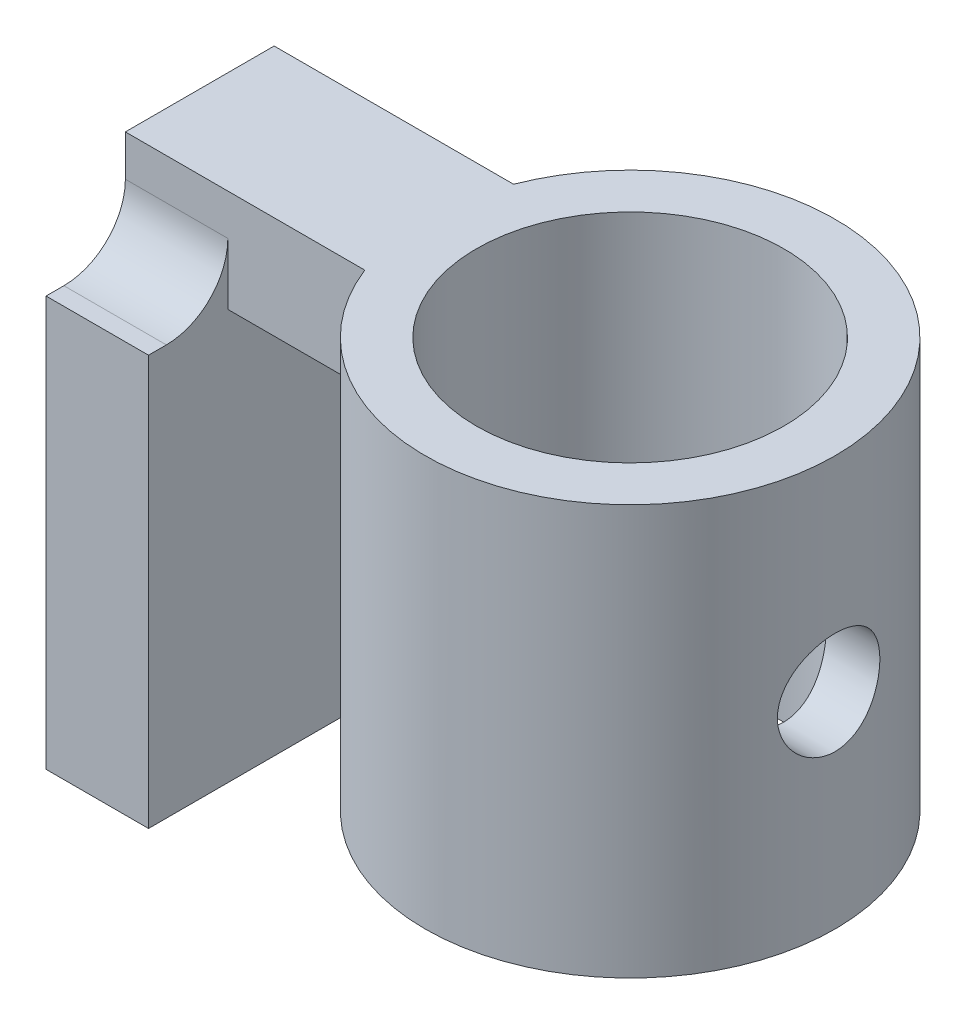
ISO-10303-21;
HEADER;
FILE_DESCRIPTION(('STEP AP214'),'2;1');
FILE_NAME('part.step','',(''),(''),'','','');
FILE_SCHEMA(('AUTOMOTIVE_DESIGN { 1 0 10303 214 1 1 1 1 }'));
ENDSEC;
DATA;
#1=APPLICATION_CONTEXT('core data for automotive mechanical design processes');
#2=APPLICATION_PROTOCOL_DEFINITION('international standard','automotive_design',2000,#1);
#3=PRODUCT_CONTEXT('',#1,'mechanical');
#4=PRODUCT('Part','Part','',(#3));
#5=PRODUCT_RELATED_PRODUCT_CATEGORY('part','',(#4));
#6=PRODUCT_DEFINITION_FORMATION('','',#4);
#7=PRODUCT_DEFINITION_CONTEXT('part definition',#1,'design');
#8=PRODUCT_DEFINITION('design','',#6,#7);
#9=PRODUCT_DEFINITION_SHAPE('','',#8);
#10=(LENGTH_UNIT() NAMED_UNIT(*) SI_UNIT(.MILLI.,.METRE.));
#11=(NAMED_UNIT(*) PLANE_ANGLE_UNIT() SI_UNIT($,.RADIAN.));
#12=(NAMED_UNIT(*) SI_UNIT($,.STERADIAN.) SOLID_ANGLE_UNIT());
#13=UNCERTAINTY_MEASURE_WITH_UNIT(LENGTH_MEASURE(1.E-05),#10,'distance_accuracy_value','');
#14=(GEOMETRIC_REPRESENTATION_CONTEXT(3) GLOBAL_UNCERTAINTY_ASSIGNED_CONTEXT((#13)) GLOBAL_UNIT_ASSIGNED_CONTEXT((#10,
#11,#12)) REPRESENTATION_CONTEXT('',''));
#15=CARTESIAN_POINT('',(0.,0.,0.));
#16=DIRECTION('',(0.,0.,1.));
#17=DIRECTION('',(1.,0.,0.));
#18=AXIS2_PLACEMENT_3D('',#15,#16,#17);
#19=CARTESIAN_POINT('',(21.,25.,7.5));
#20=DIRECTION('',(0.,-1.,0.));
#21=DIRECTION('',(0.,0.,-1.));
#22=AXIS2_PLACEMENT_3D('',#19,#20,#21);
#23=CYLINDRICAL_SURFACE('',#22,10.);
#24=CARTESIAN_POINT('',(30.6824583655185,15.,10.));
#25=CARTESIAN_POINT('',(30.6824590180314,15.1381886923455,10.0000042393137));
#26=CARTESIAN_POINT('',(30.685538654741,15.276421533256,9.9881596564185));
#27=CARTESIAN_POINT('',(30.6973219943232,15.548921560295,9.94182137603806));
#28=CARTESIAN_POINT('',(30.7060340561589,15.6831825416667,9.90729401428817));
#29=CARTESIAN_POINT('',(30.727930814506,15.943673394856,9.81721754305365));
#30=CARTESIAN_POINT('',(30.7411051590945,16.0699210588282,9.76171705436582));
#31=CARTESIAN_POINT('',(30.7704754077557,16.3115091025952,9.63125731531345));
#32=CARTESIAN_POINT('',(30.7866692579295,16.4268568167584,9.55631127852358));
#33=CARTESIAN_POINT('',(30.8122390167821,16.5910723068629,9.42922591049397));
#34=CARTESIAN_POINT('',(30.8211293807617,16.6451366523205,9.383559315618));
#35=CARTESIAN_POINT('',(30.8390327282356,16.7490765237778,9.28768377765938));
#36=CARTESIAN_POINT('',(30.8480457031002,16.7989523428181,9.2374751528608));
#37=CARTESIAN_POINT('',(30.8659389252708,16.8940893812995,9.13280822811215));
#38=CARTESIAN_POINT('',(30.8748191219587,16.9393488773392,9.07834835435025));
#39=CARTESIAN_POINT('',(30.8921631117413,17.0250713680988,8.96573005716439));
#40=CARTESIAN_POINT('',(30.9006268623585,17.0655338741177,8.90757125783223));
#41=CARTESIAN_POINT('',(30.9246779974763,17.1778450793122,8.7307187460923));
#42=CARTESIAN_POINT('',(30.9393333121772,17.2426836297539,8.60734588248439));
#43=CARTESIAN_POINT('',(30.9645202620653,17.3517500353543,8.35138148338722));
#44=CARTESIAN_POINT('',(30.9750517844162,17.3959773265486,8.21878969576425));
#45=CARTESIAN_POINT('',(30.987025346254,17.4459905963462,8.01400059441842));
#46=CARTESIAN_POINT('',(30.9903961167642,17.4600077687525,7.9438435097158));
#47=CARTESIAN_POINT('',(30.995672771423,17.4819577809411,7.8025145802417));
#48=CARTESIAN_POINT('',(30.9975787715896,17.4898911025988,7.73134281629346));
#49=CARTESIAN_POINT('',(30.9998620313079,17.4994039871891,7.58859677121));
#50=CARTESIAN_POINT('',(31.000240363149,17.5009880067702,7.51702280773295));
#51=CARTESIAN_POINT('',(30.9994629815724,17.4977809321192,7.37404545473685));
#52=CARTESIAN_POINT('',(30.9983072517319,17.4929897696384,7.30264206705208));
#53=CARTESIAN_POINT('',(30.9928183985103,17.4703358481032,7.0984668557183));
#54=CARTESIAN_POINT('',(30.986592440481,17.4447139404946,6.96652726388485));
#55=CARTESIAN_POINT('',(30.9694772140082,17.3731224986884,6.70860138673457));
#56=CARTESIAN_POINT('',(30.9585833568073,17.3271329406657,6.58262109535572));
#57=CARTESIAN_POINT('',(30.9326997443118,17.2140307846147,6.33486212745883));
#58=CARTESIAN_POINT('',(30.9175671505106,17.1461661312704,6.21343749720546));
#59=CARTESIAN_POINT('',(30.8931982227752,17.0303393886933,6.04122590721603));
#60=CARTESIAN_POINT('',(30.8847970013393,16.9893926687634,5.9854767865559));
#61=CARTESIAN_POINT('',(30.8676675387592,16.9029919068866,5.87762273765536));
#62=CARTESIAN_POINT('',(30.8589393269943,16.8575382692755,5.82551748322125));
#63=CARTESIAN_POINT('',(30.8412570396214,16.7614605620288,5.72451669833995));
#64=CARTESIAN_POINT('',(30.8323017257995,16.7107581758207,5.67569579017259));
#65=CARTESIAN_POINT('',(30.8145808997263,16.6052904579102,5.58264640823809));
#66=CARTESIAN_POINT('',(30.8058154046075,16.5505247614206,5.53841834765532));
#67=CARTESIAN_POINT('',(30.7801348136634,16.3807312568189,5.41282940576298));
#68=CARTESIAN_POINT('',(30.7638385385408,16.2602224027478,5.33857977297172));
#69=CARTESIAN_POINT('',(30.7347855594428,16.0093278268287,5.21129007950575));
#70=CARTESIAN_POINT('',(30.7220037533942,15.8790210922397,5.15809834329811));
#71=CARTESIAN_POINT('',(30.7012974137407,15.6110901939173,5.07373935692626));
#72=CARTESIAN_POINT('',(30.6933680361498,15.4734734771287,5.0425501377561));
#73=CARTESIAN_POINT('',(30.6859451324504,15.2643724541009,5.01352778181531));
#74=CARTESIAN_POINT('',(30.6842169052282,15.1941054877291,5.00681766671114));
#75=CARTESIAN_POINT('',(30.6823481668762,15.0532351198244,4.99957068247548));
#76=CARTESIAN_POINT('',(30.6822075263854,14.982631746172,4.9990333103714));
#77=CARTESIAN_POINT('',(30.6842097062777,14.7711943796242,5.00677497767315));
#78=CARTESIAN_POINT('',(30.6887725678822,14.6306209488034,5.02439214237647));
#79=CARTESIAN_POINT('',(30.7030557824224,14.3627471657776,5.08101887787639));
#80=CARTESIAN_POINT('',(30.7124664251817,14.2351474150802,5.11874809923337));
#81=CARTESIAN_POINT('',(30.7351629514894,13.9874568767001,5.21330678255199));
#82=CARTESIAN_POINT('',(30.7484505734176,13.8673694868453,5.27014481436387));
#83=CARTESIAN_POINT('',(30.7707911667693,13.6912132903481,5.37093351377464));
#84=CARTESIAN_POINT('',(30.7789409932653,13.631336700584,5.40859122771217));
#85=CARTESIAN_POINT('',(30.7957526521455,13.5150117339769,5.48880366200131));
#86=CARTESIAN_POINT('',(30.8044144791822,13.458563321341,5.5313583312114));
#87=CARTESIAN_POINT('',(30.8220123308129,13.3496099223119,5.6211267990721));
#88=CARTESIAN_POINT('',(30.8309481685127,13.2971023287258,5.66833746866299));
#89=CARTESIAN_POINT('',(30.8488610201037,13.1965020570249,5.76723967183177));
#90=CARTESIAN_POINT('',(30.8578380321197,13.1484091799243,5.81893100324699));
#91=CARTESIAN_POINT('',(30.8753912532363,13.0577077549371,5.92535663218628));
#92=CARTESIAN_POINT('',(30.8839717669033,13.015016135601,5.98001949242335));
#93=CARTESIAN_POINT('',(30.9006507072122,12.9343024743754,6.09274400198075));
#94=CARTESIAN_POINT('',(30.9087491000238,12.8962807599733,6.15080588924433));
#95=CARTESIAN_POINT('',(30.9319955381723,12.7894084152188,6.32958708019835));
#96=CARTESIAN_POINT('',(30.946088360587,12.7277826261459,6.45486401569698));
#97=CARTESIAN_POINT('',(30.9701823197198,12.6243312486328,6.71697604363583));
#98=CARTESIAN_POINT('',(30.9800868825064,12.5829698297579,6.85400444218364));
#99=CARTESIAN_POINT('',(30.9907060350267,12.5387311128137,7.06329711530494));
#100=CARTESIAN_POINT('',(30.9935392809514,12.5269528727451,7.13366723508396));
#101=CARTESIAN_POINT('',(30.9977233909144,12.5095266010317,7.27521789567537));
#102=CARTESIAN_POINT('',(30.9990744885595,12.5038776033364,7.34639830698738));
#103=CARTESIAN_POINT('',(31.0002287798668,12.4990523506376,7.48664565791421));
#104=CARTESIAN_POINT('',(31.000081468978,12.4996691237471,7.55570502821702));
#105=CARTESIAN_POINT('',(30.9983661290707,12.5068387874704,7.69348098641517));
#106=CARTESIAN_POINT('',(30.9967980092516,12.5133920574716,7.76219755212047));
#107=CARTESIAN_POINT('',(30.9900116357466,12.5416427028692,7.96720562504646));
#108=CARTESIAN_POINT('',(30.982711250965,12.5719313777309,8.10233958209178));
#109=CARTESIAN_POINT('',(30.9635719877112,12.6526885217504,8.36251218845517));
#110=CARTESIAN_POINT('',(30.9518413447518,12.7026768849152,8.48771153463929));
#111=CARTESIAN_POINT('',(30.9249872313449,12.8213740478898,8.72852080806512));
#112=CARTESIAN_POINT('',(30.9098655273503,12.8900731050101,8.84413568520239));
#113=CARTESIAN_POINT('',(30.885284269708,13.008586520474,9.01150117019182));
#114=CARTESIAN_POINT('',(30.8764843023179,13.0522057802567,9.06783110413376));
#115=CARTESIAN_POINT('',(30.8586309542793,13.1442165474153,9.17642933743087));
#116=CARTESIAN_POINT('',(30.8495775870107,13.1926078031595,9.22869785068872));
#117=CARTESIAN_POINT('',(30.8314992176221,13.2938833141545,9.32871916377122));
#118=CARTESIAN_POINT('',(30.8224742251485,13.3467689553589,9.37647056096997));
#119=CARTESIAN_POINT('',(30.8046982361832,13.456481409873,9.46723873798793));
#120=CARTESIAN_POINT('',(30.7959472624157,13.5133085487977,9.51025512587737));
#121=CARTESIAN_POINT('',(30.7709574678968,13.6856962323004,9.62952449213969));
#122=CARTESIAN_POINT('',(30.7554237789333,13.8061928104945,9.69895029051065));
#123=CARTESIAN_POINT('',(30.7279657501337,14.0571100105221,9.81741245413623));
#124=CARTESIAN_POINT('',(30.7160399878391,14.187526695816,9.86645685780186));
#125=CARTESIAN_POINT('',(30.6988430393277,14.4313379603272,9.93587273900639));
#126=CARTESIAN_POINT('',(30.6927690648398,14.5436768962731,9.95977607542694));
#127=CARTESIAN_POINT('',(30.6845778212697,14.7706681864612,9.99183251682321));
#128=CARTESIAN_POINT('',(30.6824578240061,14.8853188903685,9.99999648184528));
#129=CARTESIAN_POINT('',(30.6824583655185,15.,10.));
#130=B_SPLINE_CURVE_WITH_KNOTS('',3,(#24,#25,#26,#27,#28,#29,#30,#31,#32,#33,#34,#35,#36,#37,
#38,#39,#40,#41,#42,#43,#44,#45,#46,#47,#48,#49,#50,#51,#52,#53,#54,#55,#56,#57,#58,#59,#60,#61,
#62,#63,#64,#65,#66,#67,#68,#69,#70,#71,#72,#73,#74,#75,#76,#77,#78,#79,#80,#81,#82,#83,#84,#85,
#86,#87,#88,#89,#90,#91,#92,#93,#94,#95,#96,#97,#98,#99,#100,#101,#102,#103,#104,#105,#106,#107,
#108,#109,#110,#111,#112,#113,#114,#115,#116,#117,#118,#119,#120,#121,#122,#123,#124,#125,#126,
#127,#128,#129),.UNSPECIFIED.,.T.,.F.,(4,2,2,2,2,2,2,2,2,2,2,2,2,2,2,2,2,2,2,2,2,2,2,2,2,2,2,2,
2,2,2,2,2,2,2,2,2,2,2,2,2,2,2,2,2,2,2,2,2,2,2,2,4),(0.,0.41414866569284,0.828913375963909,
1.24272240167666,1.65625097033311,1.87000947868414,2.08375301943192,2.29757606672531,
2.51142087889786,2.92986497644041,3.34832052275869,3.5629536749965,3.77756982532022,
3.99203530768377,4.20650308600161,4.60816153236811,5.01021573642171,5.4279089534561,
5.63675131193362,5.84557495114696,6.05815598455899,6.27075612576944,6.6960227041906,
7.11816787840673,7.53989095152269,7.75146649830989,7.96302480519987,8.38580648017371,
8.78442196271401,9.18321645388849,9.39661366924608,9.6100086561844,9.8232611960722,
10.0365041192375,10.2459123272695,10.4553352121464,10.8743293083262,11.3025177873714,
11.5164988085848,11.7304460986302,11.9373498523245,12.1442668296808,12.5581479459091,
12.9625107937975,13.3666634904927,13.5817938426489,13.7969128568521,14.0120984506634,
14.2273018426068,14.6450685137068,15.0626702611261,15.4066045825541,15.7503015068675),.UNSPECIFIED.);
#131=CARTESIAN_POINT('',(30.6824583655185,15.,10.));
#132=VERTEX_POINT('',#131);
#133=EDGE_CURVE('E253',#132,#132,#130,.T.);
#134=ORIENTED_EDGE('',*,*,#133,.T.);
#135=EDGE_LOOP('',(#134));
#136=FACE_BOUND('',#135,.T.);
#137=DIRECTION('',(0.,-1.,0.));
#138=VECTOR('',#137,1.);
#139=CARTESIAN_POINT('',(11.6818162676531,25.,11.1292494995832));
#140=LINE('',#139,#138);
#141=CARTESIAN_POINT('',(11.6818162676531,25.,11.1292494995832));
#142=VERTEX_POINT('',#141);
#143=CARTESIAN_POINT('',(11.6818162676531,20.,11.1292494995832));
#144=VERTEX_POINT('',#143);
#145=EDGE_CURVE('E218',#142,#144,#140,.T.);
#146=ORIENTED_EDGE('',*,*,#145,.T.);
#147=CARTESIAN_POINT('',(21.,20.,7.5));
#148=DIRECTION('',(0.,1.,0.));
#149=DIRECTION('',(0.,0.,1.));
#150=AXIS2_PLACEMENT_3D('',#147,#148,#149);
#151=CIRCLE('',#150,10.);
#152=CARTESIAN_POINT('',(11.6818162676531,20.,3.87075050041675));
#153=VERTEX_POINT('',#152);
#154=EDGE_CURVE('E214',#153,#144,#151,.T.);
#155=ORIENTED_EDGE('',*,*,#154,.F.);
#156=DIRECTION('',(0.,-1.,0.));
#157=VECTOR('',#156,1.);
#158=CARTESIAN_POINT('',(11.6818162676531,25.,3.87075050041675));
#159=LINE('',#158,#157);
#160=CARTESIAN_POINT('',(11.6818162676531,25.,3.87075050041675));
#161=VERTEX_POINT('',#160);
#162=EDGE_CURVE('E234',#161,#153,#159,.T.);
#163=ORIENTED_EDGE('',*,*,#162,.F.);
#164=CARTESIAN_POINT('',(21.,25.,7.5));
#165=DIRECTION('',(0.,1.,0.));
#166=DIRECTION('',(0.,0.,1.));
#167=AXIS2_PLACEMENT_3D('',#164,#165,#166);
#168=CIRCLE('',#167,10.);
#169=EDGE_CURVE('E140',#142,#161,#168,.T.);
#170=ORIENTED_EDGE('',*,*,#169,.F.);
#171=EDGE_LOOP('',(#146,#155,#163,#170));
#172=FACE_BOUND('',#171,.T.);
#173=CARTESIAN_POINT('',(21.,5.,7.5));
#174=DIRECTION('',(0.,1.,0.));
#175=DIRECTION('',(0.,0.,1.));
#176=AXIS2_PLACEMENT_3D('',#173,#174,#175);
#177=CIRCLE('',#176,10.);
#178=CARTESIAN_POINT('',(21.,5.,17.5));
#179=VERTEX_POINT('',#178);
#180=EDGE_CURVE('E237',#179,#179,#177,.T.);
#181=ORIENTED_EDGE('',*,*,#180,.T.);
#182=EDGE_LOOP('',(#181));
#183=FACE_BOUND('',#182,.T.);
#184=ADVANCED_FACE('F44',(#136,#172,#183),#23,.T.);
#185=CARTESIAN_POINT('',(0.,25.,0.));
#186=DIRECTION('',(0.,1.,0.));
#187=DIRECTION('',(0.,0.,1.));
#188=AXIS2_PLACEMENT_3D('',#185,#186,#187);
#189=PLANE('',#188);
#190=CARTESIAN_POINT('',(21.,25.,7.5));
#191=DIRECTION('',(0.,1.,0.));
#192=DIRECTION('',(0.,0.,1.));
#193=AXIS2_PLACEMENT_3D('',#190,#191,#192);
#194=CIRCLE('',#193,7.5);
#195=CARTESIAN_POINT('',(21.,25.,15.));
#196=VERTEX_POINT('',#195);
#197=EDGE_CURVE('E166',#196,#196,#194,.T.);
#198=ORIENTED_EDGE('',*,*,#197,.F.);
#199=EDGE_LOOP('',(#198));
#200=FACE_BOUND('',#199,.T.);
#201=ORIENTED_EDGE('',*,*,#169,.T.);
#202=DIRECTION('',(-1.,0.,0.));
#203=VECTOR('',#202,1.);
#204=CARTESIAN_POINT('',(0.,25.,3.87075050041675));
#205=LINE('',#204,#203);
#206=CARTESIAN_POINT('',(0.,25.,3.87075050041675));
#207=VERTEX_POINT('',#206);
#208=EDGE_CURVE('E133',#161,#207,#205,.T.);
#209=ORIENTED_EDGE('',*,*,#208,.T.);
#210=DIRECTION('',(0.,0.,1.));
#211=VECTOR('',#210,1.);
#212=CARTESIAN_POINT('',(0.,25.,0.));
#213=LINE('',#212,#211);
#214=CARTESIAN_POINT('',(0.,25.,11.1292494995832));
#215=VERTEX_POINT('',#214);
#216=EDGE_CURVE('E137',#207,#215,#213,.T.);
#217=ORIENTED_EDGE('',*,*,#216,.T.);
#218=DIRECTION('',(-1.,0.,0.));
#219=VECTOR('',#218,1.);
#220=CARTESIAN_POINT('',(0.,25.,11.1292494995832));
#221=LINE('',#220,#219);
#222=EDGE_CURVE('E144',#142,#215,#221,.T.);
#223=ORIENTED_EDGE('',*,*,#222,.F.);
#224=EDGE_LOOP('',(#201,#209,#217,#223));
#225=FACE_BOUND('',#224,.T.);
#226=ADVANCED_FACE('F135',(#200,#225),#189,.T.);
#227=CARTESIAN_POINT('',(0.,5.,0.));
#228=DIRECTION('',(0.,1.,0.));
#229=DIRECTION('',(0.,0.,1.));
#230=AXIS2_PLACEMENT_3D('',#227,#228,#229);
#231=PLANE('',#230);
#232=CARTESIAN_POINT('',(21.,5.,7.5));
#233=DIRECTION('',(0.,1.,0.));
#234=DIRECTION('',(0.,0.,1.));
#235=AXIS2_PLACEMENT_3D('',#232,#233,#234);
#236=CIRCLE('',#235,7.5);
#237=CARTESIAN_POINT('',(21.,5.,15.));
#238=VERTEX_POINT('',#237);
#239=EDGE_CURVE('E160',#238,#238,#236,.T.);
#240=ORIENTED_EDGE('',*,*,#239,.T.);
#241=EDGE_LOOP('',(#240));
#242=FACE_BOUND('',#241,.T.);
#243=ORIENTED_EDGE('',*,*,#180,.F.);
#244=EDGE_LOOP('',(#243));
#245=FACE_BOUND('',#244,.T.);
#246=ADVANCED_FACE('F351',(#242,#245),#231,.F.);
#247=CARTESIAN_POINT('',(0.,25.,3.87075050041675));
#248=DIRECTION('',(0.,0.,1.));
#249=DIRECTION('',(1.,0.,0.));
#250=AXIS2_PLACEMENT_3D('',#247,#248,#249);
#251=PLANE('',#250);
#252=DIRECTION('',(0.,1.,0.));
#253=VECTOR('',#252,1.);
#254=CARTESIAN_POINT('',(5.,25.,3.87075050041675));
#255=LINE('',#254,#253);
#256=CARTESIAN_POINT('',(5.,20.,3.87075050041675));
#257=VERTEX_POINT('',#256);
#258=CARTESIAN_POINT('',(5.,23.,3.87075050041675));
#259=VERTEX_POINT('',#258);
#260=EDGE_CURVE('E59',#257,#259,#255,.T.);
#261=ORIENTED_EDGE('',*,*,#260,.T.);
#262=DIRECTION('',(-1.,0.,0.));
#263=VECTOR('',#262,1.);
#264=CARTESIAN_POINT('',(0.,23.,3.87075050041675));
#265=LINE('',#264,#263);
#266=CARTESIAN_POINT('',(0.,23.,3.87075050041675));
#267=VERTEX_POINT('',#266);
#268=EDGE_CURVE('E151',#259,#267,#265,.T.);
#269=ORIENTED_EDGE('',*,*,#268,.T.);
#270=DIRECTION('',(0.,-1.,0.));
#271=VECTOR('',#270,1.);
#272=CARTESIAN_POINT('',(0.,25.,3.87075050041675));
#273=LINE('',#272,#271);
#274=EDGE_CURVE('E148',#207,#267,#273,.T.);
#275=ORIENTED_EDGE('',*,*,#274,.F.);
#276=ORIENTED_EDGE('',*,*,#208,.F.);
#277=ORIENTED_EDGE('',*,*,#162,.T.);
#278=DIRECTION('',(-1.,0.,0.));
#279=VECTOR('',#278,1.);
#280=CARTESIAN_POINT('',(0.,20.,3.87075050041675));
#281=LINE('',#280,#279);
#282=EDGE_CURVE('E221',#153,#257,#281,.T.);
#283=ORIENTED_EDGE('',*,*,#282,.T.);
#284=EDGE_LOOP('',(#261,#269,#275,#276,#277,#283));
#285=FACE_BOUND('',#284,.T.);
#286=ADVANCED_FACE('F149',(#285),#251,.F.);
#287=CARTESIAN_POINT('',(0.,25.,11.1292494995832));
#288=DIRECTION('',(0.,0.,1.));
#289=DIRECTION('',(1.,0.,0.));
#290=AXIS2_PLACEMENT_3D('',#287,#288,#289);
#291=PLANE('',#290);
#292=DIRECTION('',(0.,-1.,0.));
#293=VECTOR('',#292,1.);
#294=CARTESIAN_POINT('',(0.,25.,11.1292494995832));
#295=LINE('',#294,#293);
#296=CARTESIAN_POINT('',(0.,23.,11.1292494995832));
#297=VERTEX_POINT('',#296);
#298=EDGE_CURVE('E154',#215,#297,#295,.T.);
#299=ORIENTED_EDGE('',*,*,#298,.T.);
#300=DIRECTION('',(-1.,0.,0.));
#301=VECTOR('',#300,1.);
#302=CARTESIAN_POINT('',(0.,23.,11.1292494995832));
#303=LINE('',#302,#301);
#304=CARTESIAN_POINT('',(5.,23.,11.1292494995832));
#305=VERTEX_POINT('',#304);
#306=EDGE_CURVE('E293',#297,#305,#303,.F.);
#307=ORIENTED_EDGE('',*,*,#306,.T.);
#308=DIRECTION('',(0.,-1.,0.));
#309=VECTOR('',#308,1.);
#310=CARTESIAN_POINT('',(5.,0.,11.1292494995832));
#311=LINE('',#310,#309);
#312=CARTESIAN_POINT('',(5.,20.,11.1292494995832));
#313=VERTEX_POINT('',#312);
#314=EDGE_CURVE('E311',#305,#313,#311,.T.);
#315=ORIENTED_EDGE('',*,*,#314,.T.);
#316=DIRECTION('',(-1.,0.,0.));
#317=VECTOR('',#316,1.);
#318=CARTESIAN_POINT('',(0.,20.,11.1292494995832));
#319=LINE('',#318,#317);
#320=EDGE_CURVE('E145',#144,#313,#319,.T.);
#321=ORIENTED_EDGE('',*,*,#320,.F.);
#322=ORIENTED_EDGE('',*,*,#145,.F.);
#323=ORIENTED_EDGE('',*,*,#222,.T.);
#324=EDGE_LOOP('',(#299,#307,#315,#321,#322,#323));
#325=FACE_BOUND('',#324,.T.);
#326=ADVANCED_FACE('F345',(#325),#291,.T.);
#327=CARTESIAN_POINT('',(0.,20.,0.));
#328=DIRECTION('',(0.,1.,0.));
#329=DIRECTION('',(0.,0.,1.));
#330=AXIS2_PLACEMENT_3D('',#327,#328,#329);
#331=PLANE('',#330);
#332=ORIENTED_EDGE('',*,*,#154,.T.);
#333=ORIENTED_EDGE('',*,*,#320,.T.);
#334=DIRECTION('',(0.,0.,-1.));
#335=VECTOR('',#334,1.);
#336=CARTESIAN_POINT('',(5.,20.,0.));
#337=LINE('',#336,#335);
#338=EDGE_CURVE('E224',#313,#257,#337,.T.);
#339=ORIENTED_EDGE('',*,*,#338,.T.);
#340=ORIENTED_EDGE('',*,*,#282,.F.);
#341=EDGE_LOOP('',(#332,#333,#339,#340));
#342=FACE_BOUND('',#341,.T.);
#343=ADVANCED_FACE('F344',(#342),#331,.F.);
#344=CARTESIAN_POINT('',(5.,0.,0.));
#345=DIRECTION('',(1.,0.,0.));
#346=DIRECTION('',(0.,0.,-1.));
#347=AXIS2_PLACEMENT_3D('',#344,#345,#346);
#348=PLANE('',#347);
#349=ORIENTED_EDGE('',*,*,#338,.F.);
#350=ORIENTED_EDGE('',*,*,#314,.F.);
#351=CARTESIAN_POINT('',(5.,23.,14.1292494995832));
#352=DIRECTION('',(1.,0.,0.));
#353=DIRECTION('',(0.,0.,-1.));
#354=AXIS2_PLACEMENT_3D('',#351,#352,#353);
#355=CIRCLE('',#354,3.);
#356=CARTESIAN_POINT('',(5.,20.,14.1292494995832));
#357=VERTEX_POINT('',#356);
#358=EDGE_CURVE('E291',#305,#357,#355,.F.);
#359=ORIENTED_EDGE('',*,*,#358,.T.);
#360=DIRECTION('',(0.,0.,1.));
#361=VECTOR('',#360,1.);
#362=CARTESIAN_POINT('',(5.,20.,0.));
#363=LINE('',#362,#361);
#364=CARTESIAN_POINT('',(5.,20.,15.));
#365=VERTEX_POINT('',#364);
#366=EDGE_CURVE('E175',#357,#365,#363,.T.);
#367=ORIENTED_EDGE('',*,*,#366,.T.);
#368=DIRECTION('',(0.,-1.,0.));
#369=VECTOR('',#368,1.);
#370=CARTESIAN_POINT('',(5.,0.,15.));
#371=LINE('',#370,#369);
#372=CARTESIAN_POINT('',(5.,0.,15.));
#373=VERTEX_POINT('',#372);
#374=EDGE_CURVE('E181',#365,#373,#371,.T.);
#375=ORIENTED_EDGE('',*,*,#374,.T.);
#376=DIRECTION('',(0.,0.,-1.));
#377=VECTOR('',#376,1.);
#378=CARTESIAN_POINT('',(5.,0.,0.));
#379=LINE('',#378,#377);
#380=CARTESIAN_POINT('',(5.,0.,0.));
#381=VERTEX_POINT('',#380);
#382=EDGE_CURVE('E184',#373,#381,#379,.T.);
#383=ORIENTED_EDGE('',*,*,#382,.T.);
#384=DIRECTION('',(0.,1.,0.));
#385=VECTOR('',#384,1.);
#386=CARTESIAN_POINT('',(5.,0.,0.));
#387=LINE('',#386,#385);
#388=CARTESIAN_POINT('',(5.,20.,0.));
#389=VERTEX_POINT('',#388);
#390=EDGE_CURVE('E171',#381,#389,#387,.T.);
#391=ORIENTED_EDGE('',*,*,#390,.T.);
#392=CARTESIAN_POINT('',(5.,20.,0.870750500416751));
#393=VERTEX_POINT('',#392);
#394=EDGE_CURVE('E177',#389,#393,#363,.T.);
#395=ORIENTED_EDGE('',*,*,#394,.T.);
#396=CARTESIAN_POINT('',(5.,23.,0.870750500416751));
#397=DIRECTION('',(1.,0.,0.));
#398=DIRECTION('',(0.,0.,-1.));
#399=AXIS2_PLACEMENT_3D('',#396,#397,#398);
#400=CIRCLE('',#399,3.);
#401=EDGE_CURVE('E11',#393,#259,#400,.F.);
#402=ORIENTED_EDGE('',*,*,#401,.T.);
#403=ORIENTED_EDGE('',*,*,#260,.F.);
#404=EDGE_LOOP('',(#349,#350,#359,#367,#375,#383,#391,#395,#402,#403));
#405=FACE_BOUND('',#404,.T.);
#406=ADVANCED_FACE('F324',(#405),#348,.T.);
#407=CARTESIAN_POINT('',(5.,20.,0.));
#408=DIRECTION('',(0.,-1.,0.));
#409=DIRECTION('',(0.,0.,-1.));
#410=AXIS2_PLACEMENT_3D('',#407,#408,#409);
#411=PLANE('',#410);
#412=DIRECTION('',(0.,0.,1.));
#413=VECTOR('',#412,1.);
#414=CARTESIAN_POINT('',(0.,20.,0.));
#415=LINE('',#414,#413);
#416=CARTESIAN_POINT('',(0.,20.,0.));
#417=VERTEX_POINT('',#416);
#418=CARTESIAN_POINT('',(0.,20.,0.870750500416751));
#419=VERTEX_POINT('',#418);
#420=EDGE_CURVE('E192',#417,#419,#415,.T.);
#421=ORIENTED_EDGE('',*,*,#420,.T.);
#422=DIRECTION('',(-1.,0.,0.));
#423=VECTOR('',#422,1.);
#424=CARTESIAN_POINT('',(5.,20.,0.870750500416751));
#425=LINE('',#424,#423);
#426=EDGE_CURVE('E301',#419,#393,#425,.F.);
#427=ORIENTED_EDGE('',*,*,#426,.T.);
#428=ORIENTED_EDGE('',*,*,#394,.F.);
#429=DIRECTION('',(-1.,0.,0.));
#430=VECTOR('',#429,1.);
#431=CARTESIAN_POINT('',(5.,20.,0.));
#432=LINE('',#431,#430);
#433=EDGE_CURVE('E211',#389,#417,#432,.T.);
#434=ORIENTED_EDGE('',*,*,#433,.T.);
#435=EDGE_LOOP('',(#421,#427,#428,#434));
#436=FACE_BOUND('',#435,.T.);
#437=ADVANCED_FACE('F339',(#436),#411,.F.);
#438=CARTESIAN_POINT('',(5.,0.,0.));
#439=DIRECTION('',(0.,0.,1.));
#440=DIRECTION('',(0.,-1.,0.));
#441=AXIS2_PLACEMENT_3D('',#438,#439,#440);
#442=PLANE('',#441);
#443=DIRECTION('',(0.,1.,0.));
#444=VECTOR('',#443,1.);
#445=CARTESIAN_POINT('',(0.,0.,0.));
#446=LINE('',#445,#444);
#447=CARTESIAN_POINT('',(0.,0.,0.));
#448=VERTEX_POINT('',#447);
#449=EDGE_CURVE('E153',#448,#417,#446,.T.);
#450=ORIENTED_EDGE('',*,*,#449,.T.);
#451=ORIENTED_EDGE('',*,*,#433,.F.);
#452=ORIENTED_EDGE('',*,*,#390,.F.);
#453=DIRECTION('',(-1.,0.,0.));
#454=VECTOR('',#453,1.);
#455=CARTESIAN_POINT('',(5.,0.,0.));
#456=LINE('',#455,#454);
#457=EDGE_CURVE('E187',#381,#448,#456,.T.);
#458=ORIENTED_EDGE('',*,*,#457,.T.);
#459=EDGE_LOOP('',(#450,#451,#452,#458));
#460=FACE_BOUND('',#459,.T.);
#461=ADVANCED_FACE('F337',(#460),#442,.F.);
#462=ORIENTED_EDGE('',*,*,#366,.F.);
#463=DIRECTION('',(-1.,0.,0.));
#464=VECTOR('',#463,1.);
#465=CARTESIAN_POINT('',(5.,20.,14.1292494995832));
#466=LINE('',#465,#464);
#467=CARTESIAN_POINT('',(0.,20.,14.1292494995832));
#468=VERTEX_POINT('',#467);
#469=EDGE_CURVE('E242',#357,#468,#466,.T.);
#470=ORIENTED_EDGE('',*,*,#469,.T.);
#471=CARTESIAN_POINT('',(0.,20.,15.));
#472=VERTEX_POINT('',#471);
#473=EDGE_CURVE('E191',#468,#472,#415,.T.);
#474=ORIENTED_EDGE('',*,*,#473,.T.);
#475=DIRECTION('',(-1.,0.,0.));
#476=VECTOR('',#475,1.);
#477=CARTESIAN_POINT('',(5.,20.,15.));
#478=LINE('',#477,#476);
#479=EDGE_CURVE('E207',#365,#472,#478,.T.);
#480=ORIENTED_EDGE('',*,*,#479,.F.);
#481=EDGE_LOOP('',(#462,#470,#474,#480));
#482=FACE_BOUND('',#481,.T.);
#483=ADVANCED_FACE('F318',(#482),#411,.F.);
#484=CARTESIAN_POINT('',(5.,0.,15.));
#485=DIRECTION('',(0.,0.,-1.));
#486=DIRECTION('',(-1.,0.,0.));
#487=AXIS2_PLACEMENT_3D('',#484,#485,#486);
#488=PLANE('',#487);
#489=DIRECTION('',(0.,-1.,0.));
#490=VECTOR('',#489,1.);
#491=CARTESIAN_POINT('',(0.,0.,15.));
#492=LINE('',#491,#490);
#493=CARTESIAN_POINT('',(0.,0.,15.));
#494=VERTEX_POINT('',#493);
#495=EDGE_CURVE('E195',#472,#494,#492,.T.);
#496=ORIENTED_EDGE('',*,*,#495,.T.);
#497=DIRECTION('',(-1.,0.,0.));
#498=VECTOR('',#497,1.);
#499=CARTESIAN_POINT('',(5.,0.,15.));
#500=LINE('',#499,#498);
#501=EDGE_CURVE('E203',#373,#494,#500,.T.);
#502=ORIENTED_EDGE('',*,*,#501,.F.);
#503=ORIENTED_EDGE('',*,*,#374,.F.);
#504=ORIENTED_EDGE('',*,*,#479,.T.);
#505=EDGE_LOOP('',(#496,#502,#503,#504));
#506=FACE_BOUND('',#505,.T.);
#507=ADVANCED_FACE('F328',(#506),#488,.F.);
#508=CARTESIAN_POINT('',(5.,0.,0.));
#509=DIRECTION('',(0.,1.,0.));
#510=DIRECTION('',(0.,0.,1.));
#511=AXIS2_PLACEMENT_3D('',#508,#509,#510);
#512=PLANE('',#511);
#513=DIRECTION('',(0.,0.,-1.));
#514=VECTOR('',#513,1.);
#515=CARTESIAN_POINT('',(0.,0.,0.));
#516=LINE('',#515,#514);
#517=EDGE_CURVE('E176',#494,#448,#516,.T.);
#518=ORIENTED_EDGE('',*,*,#517,.T.);
#519=ORIENTED_EDGE('',*,*,#457,.F.);
#520=ORIENTED_EDGE('',*,*,#382,.F.);
#521=ORIENTED_EDGE('',*,*,#501,.T.);
#522=EDGE_LOOP('',(#518,#519,#520,#521));
#523=FACE_BOUND('',#522,.T.);
#524=ADVANCED_FACE('F332',(#523),#512,.F.);
#525=CARTESIAN_POINT('',(0.,0.,0.));
#526=DIRECTION('',(1.,0.,0.));
#527=DIRECTION('',(0.,0.,-1.));
#528=AXIS2_PLACEMENT_3D('',#525,#526,#527);
#529=PLANE('',#528);
#530=ORIENTED_EDGE('',*,*,#449,.F.);
#531=ORIENTED_EDGE('',*,*,#517,.F.);
#532=ORIENTED_EDGE('',*,*,#495,.F.);
#533=ORIENTED_EDGE('',*,*,#473,.F.);
#534=CARTESIAN_POINT('',(0.,23.,14.1292494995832));
#535=DIRECTION('',(1.,0.,0.));
#536=DIRECTION('',(0.,0.,-1.));
#537=AXIS2_PLACEMENT_3D('',#534,#535,#536);
#538=CIRCLE('',#537,3.);
#539=EDGE_CURVE('E297',#468,#297,#538,.T.);
#540=ORIENTED_EDGE('',*,*,#539,.T.);
#541=ORIENTED_EDGE('',*,*,#298,.F.);
#542=ORIENTED_EDGE('',*,*,#216,.F.);
#543=ORIENTED_EDGE('',*,*,#274,.T.);
#544=CARTESIAN_POINT('',(0.,23.,0.870750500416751));
#545=DIRECTION('',(1.,0.,0.));
#546=DIRECTION('',(0.,0.,-1.));
#547=AXIS2_PLACEMENT_3D('',#544,#545,#546);
#548=CIRCLE('',#547,3.);
#549=EDGE_CURVE('E53',#267,#419,#548,.T.);
#550=ORIENTED_EDGE('',*,*,#549,.T.);
#551=ORIENTED_EDGE('',*,*,#420,.F.);
#552=EDGE_LOOP('',(#530,#531,#532,#533,#540,#541,#542,#543,#550,#551));
#553=FACE_BOUND('',#552,.T.);
#554=ADVANCED_FACE('F157',(#553),#529,.F.);
#555=CARTESIAN_POINT('',(21.,0.,7.5));
#556=DIRECTION('',(0.,1.,0.));
#557=DIRECTION('',(0.,0.,1.));
#558=AXIS2_PLACEMENT_3D('',#555,#556,#557);
#559=CYLINDRICAL_SURFACE('',#558,7.5);
#560=ORIENTED_EDGE('',*,*,#239,.F.);
#561=EDGE_LOOP('',(#560));
#562=FACE_BOUND('',#561,.T.);
#563=ORIENTED_EDGE('',*,*,#197,.T.);
#564=EDGE_LOOP('',(#563));
#565=FACE_BOUND('',#564,.T.);
#566=CARTESIAN_POINT('',(28.0710678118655,15.,10.));
#567=CARTESIAN_POINT('',(28.0710710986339,14.8638184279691,9.99999049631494));
#568=CARTESIAN_POINT('',(28.0751777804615,14.7276380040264,9.98846256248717));
#569=CARTESIAN_POINT('',(28.0908425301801,14.4593077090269,9.94346084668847));
#570=CARTESIAN_POINT('',(28.102409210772,14.3271626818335,9.90996169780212));
#571=CARTESIAN_POINT('',(28.1313930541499,14.0709036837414,9.82278308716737));
#572=CARTESIAN_POINT('',(28.1487918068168,13.9467658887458,9.76916706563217));
#573=CARTESIAN_POINT('',(28.1875024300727,13.709043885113,9.64339087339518));
#574=CARTESIAN_POINT('',(28.2088124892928,13.5954548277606,9.57123928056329));
#575=CARTESIAN_POINT('',(28.2544108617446,13.3759838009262,9.40559228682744));
#576=CARTESIAN_POINT('',(28.2787962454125,13.2708052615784,9.31118529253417));
#577=CARTESIAN_POINT('',(28.3269632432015,13.078617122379,9.10521481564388));
#578=CARTESIAN_POINT('',(28.3507446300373,12.9916142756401,8.99364498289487));
#579=CARTESIAN_POINT('',(28.3945783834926,12.8381589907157,8.7587086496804));
#580=CARTESIAN_POINT('',(28.4146749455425,12.7714556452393,8.63551312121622));
#581=CARTESIAN_POINT('',(28.4494108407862,12.6586262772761,8.37917140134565));
#582=CARTESIAN_POINT('',(28.464049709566,12.6125020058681,8.24602436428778));
#583=CARTESIAN_POINT('',(28.4807947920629,12.5600139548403,8.04086806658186));
#584=CARTESIAN_POINT('',(28.4855205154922,12.5452621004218,7.97112056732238));
#585=CARTESIAN_POINT('',(28.4930443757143,12.5217725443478,7.83049891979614));
#586=CARTESIAN_POINT('',(28.495842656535,12.5130343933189,7.75962485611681));
#587=CARTESIAN_POINT('',(28.4994183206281,12.5018418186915,7.61740064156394));
#588=CARTESIAN_POINT('',(28.5001977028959,12.4993811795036,7.54605103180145));
#589=CARTESIAN_POINT('',(28.4997172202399,12.5008890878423,7.40342868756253));
#590=CARTESIAN_POINT('',(28.4984574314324,12.5048573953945,7.33215595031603));
#591=CARTESIAN_POINT('',(28.4941203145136,12.5184136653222,7.19599143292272));
#592=CARTESIAN_POINT('',(28.4911969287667,12.5275251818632,7.1310465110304));
#593=CARTESIAN_POINT('',(28.483738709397,12.5507917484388,7.00217633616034));
#594=CARTESIAN_POINT('',(28.4792039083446,12.5649466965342,6.93825106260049));
#595=CARTESIAN_POINT('',(28.4633281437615,12.6147185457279,6.74846281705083));
#596=CARTESIAN_POINT('',(28.4497174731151,12.6576374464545,6.62463555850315));
#597=CARTESIAN_POINT('',(28.4169779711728,12.7637687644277,6.38002059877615));
#598=CARTESIAN_POINT('',(28.3976278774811,12.827809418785,6.25962210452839));
#599=CARTESIAN_POINT('',(28.3661755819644,12.9373582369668,6.08831618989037));
#600=CARTESIAN_POINT('',(28.3552874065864,12.9761207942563,6.03276474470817));
#601=CARTESIAN_POINT('',(28.3329817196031,13.0580094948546,5.92507318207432));
#602=CARTESIAN_POINT('',(28.3215642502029,13.1011352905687,5.87293279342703));
#603=CARTESIAN_POINT('',(28.2980303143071,13.1935340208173,5.77036348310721));
#604=CARTESIAN_POINT('',(28.2859047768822,13.2429904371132,5.72010178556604));
#605=CARTESIAN_POINT('',(28.2617853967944,13.3461636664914,5.62412051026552));
#606=CARTESIAN_POINT('',(28.2497915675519,13.3998809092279,5.57840139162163));
#607=CARTESIAN_POINT('',(28.2262348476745,13.5111479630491,5.49162924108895));
#608=CARTESIAN_POINT('',(28.2146724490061,13.5687019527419,5.45058143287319));
#609=CARTESIAN_POINT('',(28.1923049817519,13.6871425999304,5.37341553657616));
#610=CARTESIAN_POINT('',(28.1814999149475,13.7480292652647,5.33729746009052));
#611=CARTESIAN_POINT('',(28.1508727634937,13.9338316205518,5.23728805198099));
#612=CARTESIAN_POINT('',(28.1325739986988,14.0630983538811,5.18080592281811));
#613=CARTESIAN_POINT('',(28.102303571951,14.3297360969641,5.08968453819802));
#614=CARTESIAN_POINT('',(28.0903252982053,14.4670984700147,5.05502244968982));
#615=CARTESIAN_POINT('',(28.078424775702,14.6757615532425,5.02088230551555));
#616=CARTESIAN_POINT('',(28.0754689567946,14.7455137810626,5.012476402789));
#617=CARTESIAN_POINT('',(28.0716795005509,14.8855361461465,5.00172471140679));
#618=CARTESIAN_POINT('',(28.0708456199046,14.9558062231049,4.99937822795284));
#619=CARTESIAN_POINT('',(28.0716631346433,15.1664560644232,5.00167049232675));
#620=CARTESIAN_POINT('',(28.0766244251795,15.3068322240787,5.01561491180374));
#621=CARTESIAN_POINT('',(28.0936167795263,15.571923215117,5.06460083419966));
#622=CARTESIAN_POINT('',(28.1050709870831,15.6970093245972,5.09792608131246));
#623=CARTESIAN_POINT('',(28.1331845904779,15.9403051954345,5.18274365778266));
#624=CARTESIAN_POINT('',(28.1498474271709,16.0585103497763,5.23424799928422));
#625=CARTESIAN_POINT('',(28.1882271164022,16.2945785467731,5.35897978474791));
#626=CARTESIAN_POINT('',(28.2102417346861,16.4116570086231,5.43361593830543));
#627=CARTESIAN_POINT('',(28.2446377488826,16.5764609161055,5.55909755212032));
#628=CARTESIAN_POINT('',(28.2563338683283,16.6296000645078,5.6031865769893));
#629=CARTESIAN_POINT('',(28.2799010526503,16.7318918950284,5.6957494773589));
#630=CARTESIAN_POINT('',(28.2917721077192,16.7810447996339,5.74422310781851));
#631=CARTESIAN_POINT('',(28.3155265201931,16.875726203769,5.84596351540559));
#632=CARTESIAN_POINT('',(28.3274074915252,16.9211907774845,5.89929029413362));
#633=CARTESIAN_POINT('',(28.3506518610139,17.0074840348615,6.00966236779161));
#634=CARTESIAN_POINT('',(28.36201520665,17.0483122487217,6.06670803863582));
#635=CARTESIAN_POINT('',(28.3948640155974,17.1635919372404,6.24293150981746));
#636=CARTESIAN_POINT('',(28.4151045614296,17.2308243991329,6.36718055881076));
#637=CARTESIAN_POINT('',(28.4501062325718,17.3444389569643,6.62645253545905));
#638=CARTESIAN_POINT('',(28.464837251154,17.3907067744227,6.76152989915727));
#639=CARTESIAN_POINT('',(28.4814842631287,17.4426253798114,6.9687451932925));
#640=CARTESIAN_POINT('',(28.4861246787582,17.4570167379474,7.03857087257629));
#641=CARTESIAN_POINT('',(28.4934712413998,17.4797749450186,7.17931272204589));
#642=CARTESIAN_POINT('',(28.4961775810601,17.4881423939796,7.25022878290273));
#643=CARTESIAN_POINT('',(28.4995001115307,17.4984417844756,7.38968997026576));
#644=CARTESIAN_POINT('',(28.5001963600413,17.5006201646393,7.45821507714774));
#645=CARTESIAN_POINT('',(28.4997085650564,17.4990800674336,7.59519127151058));
#646=CARTESIAN_POINT('',(28.4985245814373,17.4953617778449,7.66364236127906));
#647=CARTESIAN_POINT('',(28.4943092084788,17.4822001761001,7.79996841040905));
#648=CARTESIAN_POINT('',(28.4912768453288,17.4727538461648,7.86784304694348));
#649=CARTESIAN_POINT('',(28.4834532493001,17.4483555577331,8.00247792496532));
#650=CARTESIAN_POINT('',(28.478661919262,17.4334032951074,8.06923810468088));
#651=CARTESIAN_POINT('',(28.4622811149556,17.3820282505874,8.26187893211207));
#652=CARTESIAN_POINT('',(28.4484895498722,17.3384986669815,8.38574521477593));
#653=CARTESIAN_POINT('',(28.4161424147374,17.2334712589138,8.62490556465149));
#654=CARTESIAN_POINT('',(28.3975868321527,17.1719733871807,8.74019960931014));
#655=CARTESIAN_POINT('',(28.366684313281,17.0644687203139,8.90911813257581));
#656=CARTESIAN_POINT('',(28.3554004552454,17.0243213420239,8.96674423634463));
#657=CARTESIAN_POINT('',(28.3322655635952,16.9393419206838,9.07832832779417));
#658=CARTESIAN_POINT('',(28.3204145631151,16.894510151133,9.13228652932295));
#659=CARTESIAN_POINT('',(28.2965065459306,16.8003095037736,9.23603906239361));
#660=CARTESIAN_POINT('',(28.2844495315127,16.7509406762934,9.28583344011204));
#661=CARTESIAN_POINT('',(28.260465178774,16.6480788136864,9.38097117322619));
#662=CARTESIAN_POINT('',(28.2485378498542,16.5945854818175,9.42631420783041));
#663=CARTESIAN_POINT('',(28.2135690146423,16.429255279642,9.55481658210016));
#664=CARTESIAN_POINT('',(28.19116161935,16.3118862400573,9.63119300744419));
#665=CARTESIAN_POINT('',(28.1505006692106,16.0656412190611,9.76388638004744));
#666=CARTESIAN_POINT('',(28.1322488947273,15.9367603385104,9.82019473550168));
#667=CARTESIAN_POINT('',(28.1025681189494,15.6750427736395,9.9094972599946));
#668=CARTESIAN_POINT('',(28.0909386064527,15.5424665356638,9.94318286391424));
#669=CARTESIAN_POINT('',(28.0751915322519,15.2732562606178,9.98842507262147));
#670=CARTESIAN_POINT('',(28.0710645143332,15.1366275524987,10.0000095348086));
#671=CARTESIAN_POINT('',(28.0710678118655,15.,10.));
#672=B_SPLINE_CURVE_WITH_KNOTS('',3,(#566,#567,#568,#569,#570,#571,#572,#573,#574,#575,#576,
#577,#578,#579,#580,#581,#582,#583,#584,#585,#586,#587,#588,#589,#590,#591,#592,#593,#594,#595,
#596,#597,#598,#599,#600,#601,#602,#603,#604,#605,#606,#607,#608,#609,#610,#611,#612,#613,#614,
#615,#616,#617,#618,#619,#620,#621,#622,#623,#624,#625,#626,#627,#628,#629,#630,#631,#632,#633,
#634,#635,#636,#637,#638,#639,#640,#641,#642,#643,#644,#645,#646,#647,#648,#649,#650,#651,#652,
#653,#654,#655,#656,#657,#658,#659,#660,#661,#662,#663,#664,#665,#666,#667,#668,#669,#670,#671),
.UNSPECIFIED.,.T.,.F.,(4,2,2,2,2,2,2,2,2,2,2,2,2,2,2,2,2,2,2,2,2,2,2,2,2,2,2,2,2,2,2,2,2,2,2,2,
2,2,2,2,2,2,2,2,2,2,2,2,2,2,2,2,4),(0.,0.408045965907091,0.816563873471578,1.22380416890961,
1.63085634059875,2.05898161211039,2.48726567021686,2.91001819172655,3.33280667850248,
3.5469110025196,3.76099932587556,3.97487559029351,4.1887438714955,4.3854522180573,
4.58215658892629,4.97570888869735,5.38701751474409,5.59265657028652,5.79827925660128,
6.01265121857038,6.22704482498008,6.44167586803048,6.65630741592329,7.08097412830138,
7.50519571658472,7.71589522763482,7.92657057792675,8.34745124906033,8.73575930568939,
9.12432442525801,9.54398885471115,9.75388097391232,9.96376137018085,10.1767280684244,
10.3897163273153,10.8157551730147,11.2440892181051,11.4581812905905,11.6722520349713,
11.8776705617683,12.0830825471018,12.2886028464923,12.4941344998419,12.888430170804,
13.2827268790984,13.4959125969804,13.7090858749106,13.9222567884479,14.1354430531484,
14.5587792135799,14.9822964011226,15.3921956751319,15.8015779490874),.UNSPECIFIED.);
#673=CARTESIAN_POINT('',(28.0710678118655,15.,10.));
#674=VERTEX_POINT('',#673);
#675=EDGE_CURVE('E244',#674,#674,#672,.T.);
#676=ORIENTED_EDGE('',*,*,#675,.T.);
#677=EDGE_LOOP('',(#676));
#678=FACE_BOUND('',#677,.T.);
#679=ADVANCED_FACE('F255',(#562,#565,#678),#559,.F.);
#680=CARTESIAN_POINT('',(13.9289321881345,15.,10.));
#681=CARTESIAN_POINT('',(13.9289321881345,14.3341763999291,10.));
#682=CARTESIAN_POINT('',(13.8222663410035,13.6896841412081,9.72528834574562));
#683=CARTESIAN_POINT('',(13.6002880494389,12.7745103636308,8.80997395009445));
#684=CARTESIAN_POINT('',(13.5001458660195,12.5004375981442,8.15932683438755));
#685=CARTESIAN_POINT('',(13.4998545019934,12.4995635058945,6.84399587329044));
#686=CARTESIAN_POINT('',(13.5998268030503,12.7724250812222,6.19172153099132));
#687=CARTESIAN_POINT('',(13.8230912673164,13.6932691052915,5.27151689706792));
#688=CARTESIAN_POINT('',(13.9288365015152,14.3431918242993,5.00027064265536));
#689=CARTESIAN_POINT('',(13.9290277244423,15.6547462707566,4.99972978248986));
#690=CARTESIAN_POINT('',(13.8234875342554,16.305082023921,5.26989990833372));
#691=CARTESIAN_POINT('',(13.5994590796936,17.2291060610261,6.19322087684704));
#692=CARTESIAN_POINT('',(13.5000132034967,17.4999603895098,6.84085633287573));
#693=CARTESIAN_POINT('',(13.4999867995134,17.5000396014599,8.15884316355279));
#694=CARTESIAN_POINT('',(13.6001543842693,17.2260747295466,8.80946106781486));
#695=CARTESIAN_POINT('',(13.8224676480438,16.3094518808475,9.72608013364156));
#696=CARTESIAN_POINT('',(13.9289321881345,15.6658236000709,10.));
#697=CARTESIAN_POINT('',(13.9289321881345,15.,10.));
#698=B_SPLINE_CURVE_WITH_KNOTS('',3,(#680,#681,#682,#683,#684,#685,#686,#687,#688,#689,#690,
#691,#692,#693,#694,#695,#696,#697),.UNSPECIFIED.,.T.,.F.,(4,2,2,2,2,2,2,2,4),(0.,0.125,0.25,
0.375,0.5,0.625,0.75,0.875,1.),.UNSPECIFIED.);
#699=DIRECTION('',(1.,0.,0.));
#700=VECTOR('',#699,1.);
#701=SURFACE_OF_LINEAR_EXTRUSION('',#698,#700);
#702=ORIENTED_EDGE('',*,*,#675,.F.);
#703=EDGE_LOOP('',(#702));
#704=FACE_BOUND('',#703,.T.);
#705=ORIENTED_EDGE('',*,*,#133,.F.);
#706=EDGE_LOOP('',(#705));
#707=FACE_BOUND('',#706,.T.);
#708=ADVANCED_FACE('F258',(#704,#707),#701,.F.);
#709=CARTESIAN_POINT('',(5.,23.,14.1292494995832));
#710=DIRECTION('',(-1.,0.,0.));
#711=DIRECTION('',(0.,0.,1.));
#712=AXIS2_PLACEMENT_3D('',#709,#710,#711);
#713=CYLINDRICAL_SURFACE('',#712,3.);
#714=ORIENTED_EDGE('',*,*,#358,.F.);
#715=ORIENTED_EDGE('',*,*,#306,.F.);
#716=ORIENTED_EDGE('',*,*,#539,.F.);
#717=ORIENTED_EDGE('',*,*,#469,.F.);
#718=EDGE_LOOP('',(#714,#715,#716,#717));
#719=FACE_BOUND('',#718,.T.);
#720=ADVANCED_FACE('F262',(#719),#713,.F.);
#721=CARTESIAN_POINT('',(0.,23.,0.870750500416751));
#722=DIRECTION('',(1.,0.,0.));
#723=DIRECTION('',(0.,0.,-1.));
#724=AXIS2_PLACEMENT_3D('',#721,#722,#723);
#725=CYLINDRICAL_SURFACE('',#724,3.);
#726=ORIENTED_EDGE('',*,*,#401,.F.);
#727=ORIENTED_EDGE('',*,*,#426,.F.);
#728=ORIENTED_EDGE('',*,*,#549,.F.);
#729=ORIENTED_EDGE('',*,*,#268,.F.);
#730=EDGE_LOOP('',(#726,#727,#728,#729));
#731=FACE_BOUND('',#730,.T.);
#732=ADVANCED_FACE('F46',(#731),#725,.F.);
#733=CLOSED_SHELL('',(#184,#226,#246,#286,#326,#343,#406,#437,#461,#483,#507,#524,#554,#679,
#708,#720,#732));
#734=MANIFOLD_SOLID_BREP('B2',#733);
#735=ADVANCED_BREP_SHAPE_REPRESENTATION('',(#18,#734),#14);
#736=SHAPE_DEFINITION_REPRESENTATION(#9,#735);
ENDSEC;
END-ISO-10303-21;
